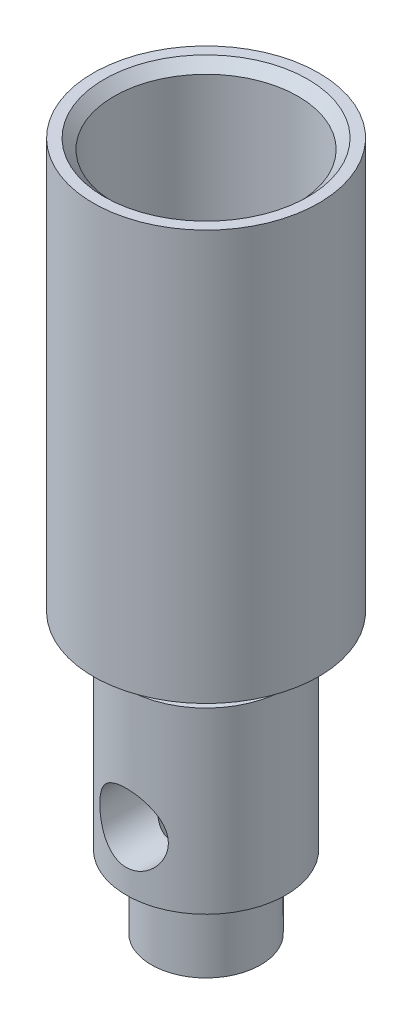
from build123d import *

# Parameters (mm, degrees)
FILLET1_R          = 0.7874
SKETCH2_R          = 2.3876
CUT_EXTRUDE1_DEPTH = 50.276526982


with BuildPart() as part:
    # Sketch1 → Base-Revolve (revolve)
    with BuildSketch(Plane.XY, mode=Mode.PRIVATE) as base_revolve_sk:
        Polygon((2.3876, 0), (3.81, 0), (3.81, 5.08), (5.55625, 5.08), (5.55625, 17.526), (4.6228, 17.526), (4.6228, 19.431), (7.8613, 19.431), (7.8613, 48.006), (7.0993, 48.006), (6.4135, 47.3202), (6.4135, 25.781), (2.3876, 25.781), align=None)
    revolve(base_revolve_sk.sketch.rotate(Axis((0, 0, 0), (0, 1, 0)), 90), axis=Axis((0, 0, 0), (0, 1, 0)))

    # Fillet1
    fillet1_edges = [part.edges().sort_by_distance(p)[0] for p in [
        (0, 19.431, 4.6228),
    ]]
    fillet(fillet1_edges, radius=FILLET1_R)

    # Sketch2 → Cut-Extrude1 (cut, through all)
    with BuildSketch(Plane.XY):
        with Locations(Location((0, 9.144, 0), (0, 0, 180))):
            Circle(SKETCH2_R)
    extrude(amount=CUT_EXTRUDE1_DEPTH, mode=Mode.SUBTRACT)


solid = part.part
